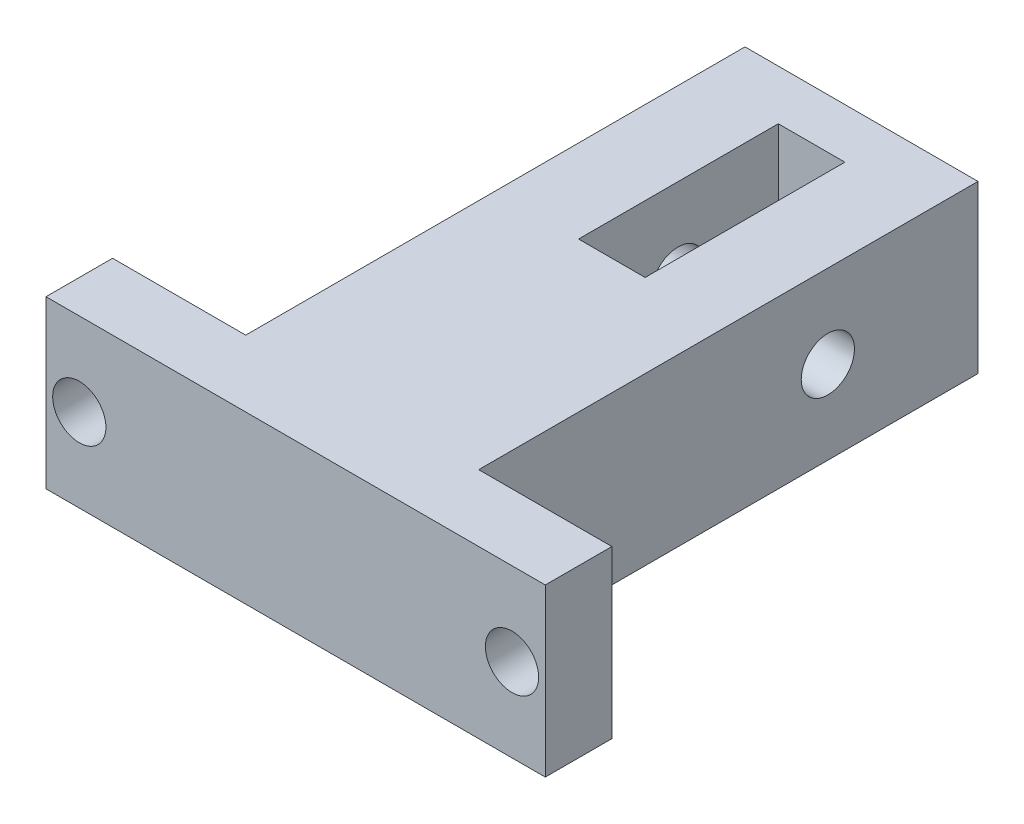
ISO-10303-21;
HEADER;
FILE_DESCRIPTION(('STEP AP214'),'2;1');
FILE_NAME('part.step','',(''),(''),'','','');
FILE_SCHEMA(('AUTOMOTIVE_DESIGN { 1 0 10303 214 1 1 1 1 }'));
ENDSEC;
DATA;
#1=APPLICATION_CONTEXT('core data for automotive mechanical design processes');
#2=APPLICATION_PROTOCOL_DEFINITION('international standard','automotive_design',2000,#1);
#3=PRODUCT_CONTEXT('',#1,'mechanical');
#4=PRODUCT('Part','Part','',(#3));
#5=PRODUCT_RELATED_PRODUCT_CATEGORY('part','',(#4));
#6=PRODUCT_DEFINITION_FORMATION('','',#4);
#7=PRODUCT_DEFINITION_CONTEXT('part definition',#1,'design');
#8=PRODUCT_DEFINITION('design','',#6,#7);
#9=PRODUCT_DEFINITION_SHAPE('','',#8);
#10=(LENGTH_UNIT() NAMED_UNIT(*) SI_UNIT(.MILLI.,.METRE.));
#11=(NAMED_UNIT(*) PLANE_ANGLE_UNIT() SI_UNIT($,.RADIAN.));
#12=(NAMED_UNIT(*) SI_UNIT($,.STERADIAN.) SOLID_ANGLE_UNIT());
#13=UNCERTAINTY_MEASURE_WITH_UNIT(LENGTH_MEASURE(1.E-05),#10,'distance_accuracy_value','');
#14=(GEOMETRIC_REPRESENTATION_CONTEXT(3) GLOBAL_UNCERTAINTY_ASSIGNED_CONTEXT((#13)) GLOBAL_UNIT_ASSIGNED_CONTEXT((#10,
#11,#12)) REPRESENTATION_CONTEXT('',''));
#15=CARTESIAN_POINT('',(0.,0.,0.));
#16=DIRECTION('',(0.,0.,1.));
#17=DIRECTION('',(1.,0.,0.));
#18=AXIS2_PLACEMENT_3D('',#15,#16,#17);
#19=CARTESIAN_POINT('',(0.,10.,0.));
#20=DIRECTION('',(0.,1.,0.));
#21=DIRECTION('',(0.,0.,1.));
#22=AXIS2_PLACEMENT_3D('',#19,#20,#21);
#23=PLANE('',#22);
#24=DIRECTION('',(0.,0.,-1.));
#25=VECTOR('',#24,1.);
#26=CARTESIAN_POINT('',(6.99999999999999,10.,-4.00000000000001));
#27=LINE('',#26,#25);
#28=CARTESIAN_POINT('',(6.99999999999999,10.,-4.00000000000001));
#29=VERTEX_POINT('',#28);
#30=CARTESIAN_POINT('',(6.99999999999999,10.,-34.));
#31=VERTEX_POINT('',#30);
#32=EDGE_CURVE('E162',#29,#31,#27,.T.);
#33=ORIENTED_EDGE('',*,*,#32,.T.);
#34=DIRECTION('',(-1.,0.,0.));
#35=VECTOR('',#34,1.);
#36=CARTESIAN_POINT('',(6.99999999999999,10.,-34.));
#37=LINE('',#36,#35);
#38=CARTESIAN_POINT('',(-7.,10.,-34.));
#39=VERTEX_POINT('',#38);
#40=EDGE_CURVE('E164',#31,#39,#37,.T.);
#41=ORIENTED_EDGE('',*,*,#40,.T.);
#42=DIRECTION('',(0.,0.,1.));
#43=VECTOR('',#42,1.);
#44=CARTESIAN_POINT('',(-7.,10.,-34.));
#45=LINE('',#44,#43);
#46=CARTESIAN_POINT('',(-7.,10.,-4.));
#47=VERTEX_POINT('',#46);
#48=EDGE_CURVE('E167',#39,#47,#45,.T.);
#49=ORIENTED_EDGE('',*,*,#48,.T.);
#50=DIRECTION('',(-1.,0.,0.));
#51=VECTOR('',#50,1.);
#52=CARTESIAN_POINT('',(-7.,10.,-4.));
#53=LINE('',#52,#51);
#54=CARTESIAN_POINT('',(-15.,10.,-4.));
#55=VERTEX_POINT('',#54);
#56=EDGE_CURVE('E169',#47,#55,#53,.T.);
#57=ORIENTED_EDGE('',*,*,#56,.T.);
#58=DIRECTION('',(0.,0.,1.));
#59=VECTOR('',#58,1.);
#60=CARTESIAN_POINT('',(-15.,10.,-4.));
#61=LINE('',#60,#59);
#62=CARTESIAN_POINT('',(-15.,10.,0.));
#63=VERTEX_POINT('',#62);
#64=EDGE_CURVE('E171',#55,#63,#61,.T.);
#65=ORIENTED_EDGE('',*,*,#64,.T.);
#66=DIRECTION('',(1.,0.,0.));
#67=VECTOR('',#66,1.);
#68=CARTESIAN_POINT('',(-15.,10.,0.));
#69=LINE('',#68,#67);
#70=CARTESIAN_POINT('',(15.,10.,0.));
#71=VERTEX_POINT('',#70);
#72=EDGE_CURVE('E173',#63,#71,#69,.T.);
#73=ORIENTED_EDGE('',*,*,#72,.T.);
#74=DIRECTION('',(0.,0.,-1.));
#75=VECTOR('',#74,1.);
#76=CARTESIAN_POINT('',(15.,10.,0.));
#77=LINE('',#76,#75);
#78=CARTESIAN_POINT('',(15.,10.,-4.00000000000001));
#79=VERTEX_POINT('',#78);
#80=EDGE_CURVE('E175',#71,#79,#77,.T.);
#81=ORIENTED_EDGE('',*,*,#80,.T.);
#82=DIRECTION('',(-1.,0.,0.));
#83=VECTOR('',#82,1.);
#84=CARTESIAN_POINT('',(15.,10.,-4.00000000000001));
#85=LINE('',#84,#83);
#86=EDGE_CURVE('E177',#79,#29,#85,.T.);
#87=ORIENTED_EDGE('',*,*,#86,.T.);
#88=EDGE_LOOP('',(#33,#41,#49,#57,#65,#73,#81,#87));
#89=FACE_BOUND('',#88,.T.);
#90=DIRECTION('',(1.,0.,0.));
#91=VECTOR('',#90,1.);
#92=CARTESIAN_POINT('',(2.,10.,-19.));
#93=LINE('',#92,#91);
#94=CARTESIAN_POINT('',(-2.,10.,-19.));
#95=VERTEX_POINT('',#94);
#96=CARTESIAN_POINT('',(2.,10.,-19.));
#97=VERTEX_POINT('',#96);
#98=EDGE_CURVE('E132',#95,#97,#93,.T.);
#99=ORIENTED_EDGE('',*,*,#98,.F.);
#100=DIRECTION('',(0.,0.,1.));
#101=VECTOR('',#100,1.);
#102=CARTESIAN_POINT('',(-2.,10.,-19.));
#103=LINE('',#102,#101);
#104=CARTESIAN_POINT('',(-2.,10.,-31.));
#105=VERTEX_POINT('',#104);
#106=EDGE_CURVE('E124',#105,#95,#103,.T.);
#107=ORIENTED_EDGE('',*,*,#106,.F.);
#108=DIRECTION('',(-1.,0.,0.));
#109=VECTOR('',#108,1.);
#110=CARTESIAN_POINT('',(1.99999999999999,10.,-31.));
#111=LINE('',#110,#109);
#112=CARTESIAN_POINT('',(1.99999999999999,10.,-31.));
#113=VERTEX_POINT('',#112);
#114=EDGE_CURVE('E146',#113,#105,#111,.T.);
#115=ORIENTED_EDGE('',*,*,#114,.F.);
#116=DIRECTION('',(0.,0.,-1.));
#117=VECTOR('',#116,1.);
#118=CARTESIAN_POINT('',(1.99999999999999,10.,-31.));
#119=LINE('',#118,#117);
#120=EDGE_CURVE('E144',#97,#113,#119,.T.);
#121=ORIENTED_EDGE('',*,*,#120,.F.);
#122=EDGE_LOOP('',(#99,#107,#115,#121));
#123=FACE_BOUND('',#122,.T.);
#124=ADVANCED_FACE('F33',(#89,#123),#23,.T.);
#125=CARTESIAN_POINT('',(0.,0.,0.));
#126=DIRECTION('',(0.,1.,0.));
#127=DIRECTION('',(0.,0.,1.));
#128=AXIS2_PLACEMENT_3D('',#125,#126,#127);
#129=PLANE('',#128);
#130=DIRECTION('',(0.,0.,-1.));
#131=VECTOR('',#130,1.);
#132=CARTESIAN_POINT('',(6.99999999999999,0.,-31.));
#133=LINE('',#132,#131);
#134=CARTESIAN_POINT('',(6.99999999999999,0.,-4.00000000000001));
#135=VERTEX_POINT('',#134);
#136=CARTESIAN_POINT('',(6.99999999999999,0.,-34.));
#137=VERTEX_POINT('',#136);
#138=EDGE_CURVE('E140',#135,#137,#133,.T.);
#139=ORIENTED_EDGE('',*,*,#138,.F.);
#140=DIRECTION('',(-1.,0.,0.));
#141=VECTOR('',#140,1.);
#142=CARTESIAN_POINT('',(15.,0.,-4.00000000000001));
#143=LINE('',#142,#141);
#144=CARTESIAN_POINT('',(15.,0.,-4.00000000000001));
#145=VERTEX_POINT('',#144);
#146=EDGE_CURVE('E165',#145,#135,#143,.T.);
#147=ORIENTED_EDGE('',*,*,#146,.F.);
#148=DIRECTION('',(0.,0.,-1.));
#149=VECTOR('',#148,1.);
#150=CARTESIAN_POINT('',(15.,0.,0.));
#151=LINE('',#150,#149);
#152=CARTESIAN_POINT('',(15.,0.,0.));
#153=VERTEX_POINT('',#152);
#154=EDGE_CURVE('E192',#153,#145,#151,.T.);
#155=ORIENTED_EDGE('',*,*,#154,.F.);
#156=DIRECTION('',(1.,0.,0.));
#157=VECTOR('',#156,1.);
#158=CARTESIAN_POINT('',(-15.,0.,0.));
#159=LINE('',#158,#157);
#160=CARTESIAN_POINT('',(-15.,0.,0.));
#161=VERTEX_POINT('',#160);
#162=EDGE_CURVE('E190',#161,#153,#159,.T.);
#163=ORIENTED_EDGE('',*,*,#162,.F.);
#164=DIRECTION('',(0.,0.,1.));
#165=VECTOR('',#164,1.);
#166=CARTESIAN_POINT('',(-15.,0.,-4.));
#167=LINE('',#166,#165);
#168=CARTESIAN_POINT('',(-15.,0.,-4.));
#169=VERTEX_POINT('',#168);
#170=EDGE_CURVE('E188',#169,#161,#167,.T.);
#171=ORIENTED_EDGE('',*,*,#170,.F.);
#172=DIRECTION('',(-1.,0.,0.));
#173=VECTOR('',#172,1.);
#174=CARTESIAN_POINT('',(-7.,0.,-4.));
#175=LINE('',#174,#173);
#176=CARTESIAN_POINT('',(-7.,0.,-4.));
#177=VERTEX_POINT('',#176);
#178=EDGE_CURVE('E186',#177,#169,#175,.T.);
#179=ORIENTED_EDGE('',*,*,#178,.F.);
#180=DIRECTION('',(0.,0.,1.));
#181=VECTOR('',#180,1.);
#182=CARTESIAN_POINT('',(-7.,0.,-31.));
#183=LINE('',#182,#181);
#184=CARTESIAN_POINT('',(-7.,0.,-34.));
#185=VERTEX_POINT('',#184);
#186=EDGE_CURVE('E184',#185,#177,#183,.T.);
#187=ORIENTED_EDGE('',*,*,#186,.F.);
#188=DIRECTION('',(-1.,0.,0.));
#189=VECTOR('',#188,1.);
#190=CARTESIAN_POINT('',(6.99999999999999,0.,-34.));
#191=LINE('',#190,#189);
#192=EDGE_CURVE('E181',#137,#185,#191,.T.);
#193=ORIENTED_EDGE('',*,*,#192,.F.);
#194=EDGE_LOOP('',(#139,#147,#155,#163,#171,#179,#187,#193));
#195=FACE_BOUND('',#194,.T.);
#196=DIRECTION('',(0.,0.,1.));
#197=VECTOR('',#196,1.);
#198=CARTESIAN_POINT('',(-2.,0.,-19.));
#199=LINE('',#198,#197);
#200=CARTESIAN_POINT('',(-2.,0.,-31.));
#201=VERTEX_POINT('',#200);
#202=CARTESIAN_POINT('',(-2.,0.,-19.));
#203=VERTEX_POINT('',#202);
#204=EDGE_CURVE('E58',#201,#203,#199,.T.);
#205=ORIENTED_EDGE('',*,*,#204,.T.);
#206=DIRECTION('',(1.,0.,0.));
#207=VECTOR('',#206,1.);
#208=CARTESIAN_POINT('',(2.,0.,-19.));
#209=LINE('',#208,#207);
#210=CARTESIAN_POINT('',(2.,0.,-19.));
#211=VERTEX_POINT('',#210);
#212=EDGE_CURVE('E139',#203,#211,#209,.T.);
#213=ORIENTED_EDGE('',*,*,#212,.T.);
#214=DIRECTION('',(0.,0.,-1.));
#215=VECTOR('',#214,1.);
#216=CARTESIAN_POINT('',(1.99999999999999,0.,-31.));
#217=LINE('',#216,#215);
#218=CARTESIAN_POINT('',(1.99999999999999,0.,-31.));
#219=VERTEX_POINT('',#218);
#220=EDGE_CURVE('E154',#211,#219,#217,.T.);
#221=ORIENTED_EDGE('',*,*,#220,.T.);
#222=DIRECTION('',(-1.,0.,0.));
#223=VECTOR('',#222,1.);
#224=CARTESIAN_POINT('',(1.99999999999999,0.,-31.));
#225=LINE('',#224,#223);
#226=EDGE_CURVE('E133',#219,#201,#225,.T.);
#227=ORIENTED_EDGE('',*,*,#226,.T.);
#228=EDGE_LOOP('',(#205,#213,#221,#227));
#229=FACE_BOUND('',#228,.T.);
#230=ADVANCED_FACE('F257',(#195,#229),#129,.F.);
#231=CARTESIAN_POINT('',(6.99999999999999,10.,-31.));
#232=DIRECTION('',(-1.,0.,0.));
#233=DIRECTION('',(0.,0.,1.));
#234=AXIS2_PLACEMENT_3D('',#231,#232,#233);
#235=PLANE('',#234);
#236=CARTESIAN_POINT('',(6.99999999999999,5.,-24.978148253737));
#237=DIRECTION('',(-1.,0.,0.));
#238=DIRECTION('',(0.,0.,1.));
#239=AXIS2_PLACEMENT_3D('',#236,#237,#238);
#240=CIRCLE('',#239,1.59999999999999);
#241=CARTESIAN_POINT('',(6.99999999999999,5.,-23.378148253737));
#242=VERTEX_POINT('',#241);
#243=EDGE_CURVE('E220',#242,#242,#240,.F.);
#244=ORIENTED_EDGE('',*,*,#243,.F.);
#245=EDGE_LOOP('',(#244));
#246=FACE_BOUND('',#245,.T.);
#247=ORIENTED_EDGE('',*,*,#138,.T.);
#248=DIRECTION('',(0.,-1.,0.));
#249=VECTOR('',#248,1.);
#250=CARTESIAN_POINT('',(6.99999999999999,10.,-34.));
#251=LINE('',#250,#249);
#252=EDGE_CURVE('E11',#31,#137,#251,.T.);
#253=ORIENTED_EDGE('',*,*,#252,.F.);
#254=ORIENTED_EDGE('',*,*,#32,.F.);
#255=DIRECTION('',(0.,-1.,0.));
#256=VECTOR('',#255,1.);
#257=CARTESIAN_POINT('',(6.99999999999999,10.,-4.00000000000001));
#258=LINE('',#257,#256);
#259=EDGE_CURVE('E179',#29,#135,#258,.T.);
#260=ORIENTED_EDGE('',*,*,#259,.T.);
#261=EDGE_LOOP('',(#247,#253,#254,#260));
#262=FACE_BOUND('',#261,.T.);
#263=ADVANCED_FACE('F35',(#246,#262),#235,.F.);
#264=CARTESIAN_POINT('',(6.99999999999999,10.,-34.));
#265=DIRECTION('',(0.,0.,1.));
#266=DIRECTION('',(1.,0.,0.));
#267=AXIS2_PLACEMENT_3D('',#264,#265,#266);
#268=PLANE('',#267);
#269=ORIENTED_EDGE('',*,*,#192,.T.);
#270=DIRECTION('',(0.,-1.,0.));
#271=VECTOR('',#270,1.);
#272=CARTESIAN_POINT('',(-7.,10.,-34.));
#273=LINE('',#272,#271);
#274=EDGE_CURVE('E42',#39,#185,#273,.T.);
#275=ORIENTED_EDGE('',*,*,#274,.F.);
#276=ORIENTED_EDGE('',*,*,#40,.F.);
#277=ORIENTED_EDGE('',*,*,#252,.T.);
#278=EDGE_LOOP('',(#269,#275,#276,#277));
#279=FACE_BOUND('',#278,.T.);
#280=ADVANCED_FACE('F287',(#279),#268,.F.);
#281=CARTESIAN_POINT('',(-7.,10.,-31.));
#282=DIRECTION('',(1.,0.,0.));
#283=DIRECTION('',(0.,0.,-1.));
#284=AXIS2_PLACEMENT_3D('',#281,#282,#283);
#285=PLANE('',#284);
#286=CARTESIAN_POINT('',(-7.,5.,-24.978148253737));
#287=DIRECTION('',(1.,0.,0.));
#288=DIRECTION('',(0.,0.,-1.));
#289=AXIS2_PLACEMENT_3D('',#286,#287,#288);
#290=CIRCLE('',#289,1.59999999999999);
#291=CARTESIAN_POINT('',(-7.,5.,-26.578148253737));
#292=VERTEX_POINT('',#291);
#293=EDGE_CURVE('E226',#292,#292,#290,.F.);
#294=ORIENTED_EDGE('',*,*,#293,.F.);
#295=EDGE_LOOP('',(#294));
#296=FACE_BOUND('',#295,.T.);
#297=ORIENTED_EDGE('',*,*,#186,.T.);
#298=DIRECTION('',(0.,-1.,0.));
#299=VECTOR('',#298,1.);
#300=CARTESIAN_POINT('',(-7.,10.,-4.));
#301=LINE('',#300,#299);
#302=EDGE_CURVE('E210',#47,#177,#301,.T.);
#303=ORIENTED_EDGE('',*,*,#302,.F.);
#304=ORIENTED_EDGE('',*,*,#48,.F.);
#305=ORIENTED_EDGE('',*,*,#274,.T.);
#306=EDGE_LOOP('',(#297,#303,#304,#305));
#307=FACE_BOUND('',#306,.T.);
#308=ADVANCED_FACE('F285',(#296,#307),#285,.F.);
#309=CARTESIAN_POINT('',(-7.,10.,-4.));
#310=DIRECTION('',(0.,0.,1.));
#311=DIRECTION('',(1.,0.,0.));
#312=AXIS2_PLACEMENT_3D('',#309,#310,#311);
#313=PLANE('',#312);
#314=CARTESIAN_POINT('',(-13.,4.99999999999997,-4.));
#315=DIRECTION('',(0.,0.,1.));
#316=DIRECTION('',(1.,0.,0.));
#317=AXIS2_PLACEMENT_3D('',#314,#315,#316);
#318=CIRCLE('',#317,1.6);
#319=CARTESIAN_POINT('',(-11.4,4.99999999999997,-4.));
#320=VERTEX_POINT('',#319);
#321=EDGE_CURVE('E152',#320,#320,#318,.T.);
#322=ORIENTED_EDGE('',*,*,#321,.T.);
#323=EDGE_LOOP('',(#322));
#324=FACE_BOUND('',#323,.T.);
#325=ORIENTED_EDGE('',*,*,#178,.T.);
#326=DIRECTION('',(0.,-1.,0.));
#327=VECTOR('',#326,1.);
#328=CARTESIAN_POINT('',(-15.,10.,-4.));
#329=LINE('',#328,#327);
#330=EDGE_CURVE('E207',#55,#169,#329,.T.);
#331=ORIENTED_EDGE('',*,*,#330,.F.);
#332=ORIENTED_EDGE('',*,*,#56,.F.);
#333=ORIENTED_EDGE('',*,*,#302,.T.);
#334=EDGE_LOOP('',(#325,#331,#332,#333));
#335=FACE_BOUND('',#334,.T.);
#336=ADVANCED_FACE('F237',(#324,#335),#313,.F.);
#337=CARTESIAN_POINT('',(-15.,10.,-4.));
#338=DIRECTION('',(1.,0.,0.));
#339=DIRECTION('',(0.,0.,-1.));
#340=AXIS2_PLACEMENT_3D('',#337,#338,#339);
#341=PLANE('',#340);
#342=ORIENTED_EDGE('',*,*,#170,.T.);
#343=DIRECTION('',(0.,-1.,0.));
#344=VECTOR('',#343,1.);
#345=CARTESIAN_POINT('',(-15.,10.,0.));
#346=LINE('',#345,#344);
#347=EDGE_CURVE('E204',#63,#161,#346,.T.);
#348=ORIENTED_EDGE('',*,*,#347,.F.);
#349=ORIENTED_EDGE('',*,*,#64,.F.);
#350=ORIENTED_EDGE('',*,*,#330,.T.);
#351=EDGE_LOOP('',(#342,#348,#349,#350));
#352=FACE_BOUND('',#351,.T.);
#353=ADVANCED_FACE('F278',(#352),#341,.F.);
#354=CARTESIAN_POINT('',(-15.,10.,0.));
#355=DIRECTION('',(0.,0.,-1.));
#356=DIRECTION('',(-1.,0.,0.));
#357=AXIS2_PLACEMENT_3D('',#354,#355,#356);
#358=PLANE('',#357);
#359=CARTESIAN_POINT('',(13.,5.,0.));
#360=DIRECTION('',(0.,0.,-1.));
#361=DIRECTION('',(-1.,0.,0.));
#362=AXIS2_PLACEMENT_3D('',#359,#360,#361);
#363=CIRCLE('',#362,1.6);
#364=CARTESIAN_POINT('',(11.4,5.,0.));
#365=VERTEX_POINT('',#364);
#366=EDGE_CURVE('E217',#365,#365,#363,.T.);
#367=ORIENTED_EDGE('',*,*,#366,.T.);
#368=EDGE_LOOP('',(#367));
#369=FACE_BOUND('',#368,.T.);
#370=CARTESIAN_POINT('',(-13.,4.99999999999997,0.));
#371=DIRECTION('',(0.,0.,-1.));
#372=DIRECTION('',(-1.,0.,0.));
#373=AXIS2_PLACEMENT_3D('',#370,#371,#372);
#374=CIRCLE('',#373,1.6);
#375=CARTESIAN_POINT('',(-14.6,4.99999999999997,0.));
#376=VERTEX_POINT('',#375);
#377=EDGE_CURVE('E215',#376,#376,#374,.T.);
#378=ORIENTED_EDGE('',*,*,#377,.T.);
#379=EDGE_LOOP('',(#378));
#380=FACE_BOUND('',#379,.T.);
#381=ORIENTED_EDGE('',*,*,#162,.T.);
#382=DIRECTION('',(0.,-1.,0.));
#383=VECTOR('',#382,1.);
#384=CARTESIAN_POINT('',(15.,10.,0.));
#385=LINE('',#384,#383);
#386=EDGE_CURVE('E201',#71,#153,#385,.T.);
#387=ORIENTED_EDGE('',*,*,#386,.F.);
#388=ORIENTED_EDGE('',*,*,#72,.F.);
#389=ORIENTED_EDGE('',*,*,#347,.T.);
#390=EDGE_LOOP('',(#381,#387,#388,#389));
#391=FACE_BOUND('',#390,.T.);
#392=ADVANCED_FACE('F274',(#369,#380,#391),#358,.F.);
#393=CARTESIAN_POINT('',(15.,10.,0.));
#394=DIRECTION('',(-1.,0.,0.));
#395=DIRECTION('',(0.,0.,1.));
#396=AXIS2_PLACEMENT_3D('',#393,#394,#395);
#397=PLANE('',#396);
#398=ORIENTED_EDGE('',*,*,#154,.T.);
#399=DIRECTION('',(0.,-1.,0.));
#400=VECTOR('',#399,1.);
#401=CARTESIAN_POINT('',(15.,10.,-4.00000000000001));
#402=LINE('',#401,#400);
#403=EDGE_CURVE('E198',#79,#145,#402,.T.);
#404=ORIENTED_EDGE('',*,*,#403,.F.);
#405=ORIENTED_EDGE('',*,*,#80,.F.);
#406=ORIENTED_EDGE('',*,*,#386,.T.);
#407=EDGE_LOOP('',(#398,#404,#405,#406));
#408=FACE_BOUND('',#407,.T.);
#409=ADVANCED_FACE('F271',(#408),#397,.F.);
#410=CARTESIAN_POINT('',(15.,10.,-4.00000000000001));
#411=DIRECTION('',(0.,0.,1.));
#412=DIRECTION('',(1.,0.,0.));
#413=AXIS2_PLACEMENT_3D('',#410,#411,#412);
#414=PLANE('',#413);
#415=CARTESIAN_POINT('',(13.,5.,-4.00000000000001));
#416=DIRECTION('',(0.,0.,1.));
#417=DIRECTION('',(1.,0.,0.));
#418=AXIS2_PLACEMENT_3D('',#415,#416,#417);
#419=CIRCLE('',#418,1.6);
#420=CARTESIAN_POINT('',(14.6,5.,-4.00000000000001));
#421=VERTEX_POINT('',#420);
#422=EDGE_CURVE('E218',#421,#421,#419,.T.);
#423=ORIENTED_EDGE('',*,*,#422,.T.);
#424=EDGE_LOOP('',(#423));
#425=FACE_BOUND('',#424,.T.);
#426=ORIENTED_EDGE('',*,*,#146,.T.);
#427=ORIENTED_EDGE('',*,*,#259,.F.);
#428=ORIENTED_EDGE('',*,*,#86,.F.);
#429=ORIENTED_EDGE('',*,*,#403,.T.);
#430=EDGE_LOOP('',(#426,#427,#428,#429));
#431=FACE_BOUND('',#430,.T.);
#432=ADVANCED_FACE('F268',(#425,#431),#414,.F.);
#433=CARTESIAN_POINT('',(-2.,10.,-19.));
#434=DIRECTION('',(1.,0.,0.));
#435=DIRECTION('',(0.,0.,-1.));
#436=AXIS2_PLACEMENT_3D('',#433,#434,#435);
#437=PLANE('',#436);
#438=CARTESIAN_POINT('',(-2.00000000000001,5.,-24.978148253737));
#439=DIRECTION('',(1.,0.,0.));
#440=DIRECTION('',(0.,0.,-1.));
#441=AXIS2_PLACEMENT_3D('',#438,#439,#440);
#442=CIRCLE('',#441,1.59999999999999);
#443=CARTESIAN_POINT('',(-2.00000000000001,5.,-26.578148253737));
#444=VERTEX_POINT('',#443);
#445=EDGE_CURVE('E231',#444,#444,#442,.F.);
#446=ORIENTED_EDGE('',*,*,#445,.T.);
#447=EDGE_LOOP('',(#446));
#448=FACE_BOUND('',#447,.T.);
#449=ORIENTED_EDGE('',*,*,#204,.F.);
#450=DIRECTION('',(0.,-1.,0.));
#451=VECTOR('',#450,1.);
#452=CARTESIAN_POINT('',(-2.,10.,-31.));
#453=LINE('',#452,#451);
#454=EDGE_CURVE('E128',#105,#201,#453,.T.);
#455=ORIENTED_EDGE('',*,*,#454,.F.);
#456=ORIENTED_EDGE('',*,*,#106,.T.);
#457=DIRECTION('',(0.,-1.,0.));
#458=VECTOR('',#457,1.);
#459=CARTESIAN_POINT('',(-2.,10.,-19.));
#460=LINE('',#459,#458);
#461=EDGE_CURVE('E127',#95,#203,#460,.T.);
#462=ORIENTED_EDGE('',*,*,#461,.T.);
#463=EDGE_LOOP('',(#449,#455,#456,#462));
#464=FACE_BOUND('',#463,.T.);
#465=ADVANCED_FACE('F126',(#448,#464),#437,.T.);
#466=CARTESIAN_POINT('',(2.,10.,-19.));
#467=DIRECTION('',(0.,0.,-1.));
#468=DIRECTION('',(-1.,0.,0.));
#469=AXIS2_PLACEMENT_3D('',#466,#467,#468);
#470=PLANE('',#469);
#471=ORIENTED_EDGE('',*,*,#212,.F.);
#472=ORIENTED_EDGE('',*,*,#461,.F.);
#473=ORIENTED_EDGE('',*,*,#98,.T.);
#474=DIRECTION('',(0.,-1.,0.));
#475=VECTOR('',#474,1.);
#476=CARTESIAN_POINT('',(2.,10.,-19.));
#477=LINE('',#476,#475);
#478=EDGE_CURVE('E141',#97,#211,#477,.T.);
#479=ORIENTED_EDGE('',*,*,#478,.T.);
#480=EDGE_LOOP('',(#471,#472,#473,#479));
#481=FACE_BOUND('',#480,.T.);
#482=ADVANCED_FACE('F136',(#481),#470,.T.);
#483=CARTESIAN_POINT('',(1.99999999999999,10.,-31.));
#484=DIRECTION('',(-1.,0.,0.));
#485=DIRECTION('',(0.,0.,1.));
#486=AXIS2_PLACEMENT_3D('',#483,#484,#485);
#487=PLANE('',#486);
#488=CARTESIAN_POINT('',(2.,5.,-24.978148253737));
#489=DIRECTION('',(-1.,0.,0.));
#490=DIRECTION('',(0.,0.,1.));
#491=AXIS2_PLACEMENT_3D('',#488,#489,#490);
#492=CIRCLE('',#491,1.59999999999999);
#493=CARTESIAN_POINT('',(2.,5.,-23.378148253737));
#494=VERTEX_POINT('',#493);
#495=EDGE_CURVE('E37',#494,#494,#492,.F.);
#496=ORIENTED_EDGE('',*,*,#495,.T.);
#497=EDGE_LOOP('',(#496));
#498=FACE_BOUND('',#497,.T.);
#499=ORIENTED_EDGE('',*,*,#220,.F.);
#500=ORIENTED_EDGE('',*,*,#478,.F.);
#501=ORIENTED_EDGE('',*,*,#120,.T.);
#502=DIRECTION('',(0.,-1.,0.));
#503=VECTOR('',#502,1.);
#504=CARTESIAN_POINT('',(1.99999999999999,10.,-31.));
#505=LINE('',#504,#503);
#506=EDGE_CURVE('E50',#113,#219,#505,.T.);
#507=ORIENTED_EDGE('',*,*,#506,.T.);
#508=EDGE_LOOP('',(#499,#500,#501,#507));
#509=FACE_BOUND('',#508,.T.);
#510=ADVANCED_FACE('F253',(#498,#509),#487,.T.);
#511=CARTESIAN_POINT('',(1.99999999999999,10.,-31.));
#512=DIRECTION('',(0.,0.,1.));
#513=DIRECTION('',(1.,0.,0.));
#514=AXIS2_PLACEMENT_3D('',#511,#512,#513);
#515=PLANE('',#514);
#516=ORIENTED_EDGE('',*,*,#226,.F.);
#517=ORIENTED_EDGE('',*,*,#506,.F.);
#518=ORIENTED_EDGE('',*,*,#114,.T.);
#519=ORIENTED_EDGE('',*,*,#454,.T.);
#520=EDGE_LOOP('',(#516,#517,#518,#519));
#521=FACE_BOUND('',#520,.T.);
#522=ADVANCED_FACE('F243',(#521),#515,.T.);
#523=CARTESIAN_POINT('',(-13.,4.99999999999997,-6.));
#524=DIRECTION('',(0.,0.,1.));
#525=DIRECTION('',(1.,0.,0.));
#526=AXIS2_PLACEMENT_3D('',#523,#524,#525);
#527=CYLINDRICAL_SURFACE('',#526,1.6);
#528=ORIENTED_EDGE('',*,*,#377,.F.);
#529=EDGE_LOOP('',(#528));
#530=FACE_BOUND('',#529,.T.);
#531=ORIENTED_EDGE('',*,*,#321,.F.);
#532=EDGE_LOOP('',(#531));
#533=FACE_BOUND('',#532,.T.);
#534=ADVANCED_FACE('F240',(#530,#533),#527,.F.);
#535=CARTESIAN_POINT('',(13.,5.,-6.));
#536=DIRECTION('',(0.,0.,1.));
#537=DIRECTION('',(1.,0.,0.));
#538=AXIS2_PLACEMENT_3D('',#535,#536,#537);
#539=CYLINDRICAL_SURFACE('',#538,1.6);
#540=ORIENTED_EDGE('',*,*,#422,.F.);
#541=EDGE_LOOP('',(#540));
#542=FACE_BOUND('',#541,.T.);
#543=ORIENTED_EDGE('',*,*,#366,.F.);
#544=EDGE_LOOP('',(#543));
#545=FACE_BOUND('',#544,.T.);
#546=ADVANCED_FACE('F242',(#542,#545),#539,.F.);
#547=CARTESIAN_POINT('',(9.,5.,-24.978148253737));
#548=DIRECTION('',(-1.,0.,0.));
#549=DIRECTION('',(0.,0.,1.));
#550=AXIS2_PLACEMENT_3D('',#547,#548,#549);
#551=CYLINDRICAL_SURFACE('',#550,1.59999999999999);
#552=ORIENTED_EDGE('',*,*,#495,.F.);
#553=EDGE_LOOP('',(#552));
#554=FACE_BOUND('',#553,.T.);
#555=ORIENTED_EDGE('',*,*,#243,.T.);
#556=EDGE_LOOP('',(#555));
#557=FACE_BOUND('',#556,.T.);
#558=ADVANCED_FACE('F250',(#554,#557),#551,.F.);
#559=ORIENTED_EDGE('',*,*,#445,.F.);
#560=EDGE_LOOP('',(#559));
#561=FACE_BOUND('',#560,.T.);
#562=ORIENTED_EDGE('',*,*,#293,.T.);
#563=EDGE_LOOP('',(#562));
#564=FACE_BOUND('',#563,.T.);
#565=ADVANCED_FACE('F337',(#561,#564),#551,.F.);
#566=CLOSED_SHELL('',(#124,#230,#263,#280,#308,#336,#353,#392,#409,#432,#465,#482,#510,#522,
#534,#546,#558,#565));
#567=MANIFOLD_SOLID_BREP('B2',#566);
#568=ADVANCED_BREP_SHAPE_REPRESENTATION('',(#18,#567),#14);
#569=SHAPE_DEFINITION_REPRESENTATION(#9,#568);
ENDSEC;
END-ISO-10303-21;
